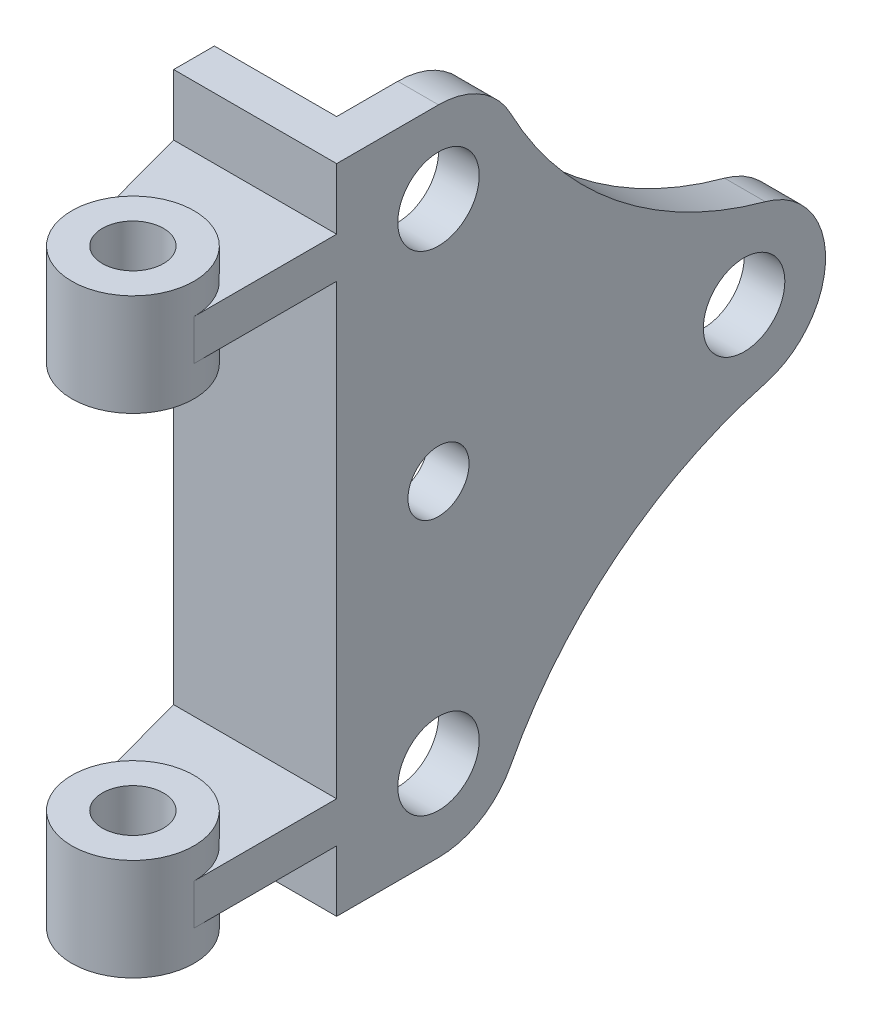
from build123d import *
from build123d.topology import SkipClean

# Parameters (mm, degrees)
BASE_EXTRUDE_DEPTH  = 6.35
SKETCH4_R           = 6.35
SKETCH4_R_2         = 4.7625
CUT_EXTRUDE1_DEPTH  = 128.158650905
SKETCH3_W           = 25.4
SKETCH3_H           = 101.6
BOSS_EXTRUDE1_DEPTH = 6.35
BOSS_EXTRUDE2_DEPTH = 3.175
SKETCH6_R           = 9.525
BOSS_EXTRUDE3_DEPTH = 7.9375
SKETCH7_R           = 4.7625
CUT_EXTRUDE2_DEPTH  = 125.686983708


with BuildPart() as part:
    # Sketch2 → Base-Extrude (new body)
    with BuildSketch(Plane(origin=(0, 0, 0), x_dir=(0, 0, -1), z_dir=(1, 0, 0))):
        with BuildLine():
            Line((0, 0), (0, 101.6))
            Line((0, 101.6), (15.875, 101.6))
            ThreePointArc((15.875, 101.6), (22.439736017, 99.771717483), (27.114363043, 94.813266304))
            ThreePointArc((27.114363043, 94.813266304), (43.64304274, 74.794428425), (66.801863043, 63.063266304))
            ThreePointArc((66.801863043, 63.063266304), (76.2, 50.8), (66.801863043, 38.536733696))
            ThreePointArc((66.801863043, 38.536733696), (43.64304274, 26.805571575), (27.114363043, 6.786733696))
            ThreePointArc((27.114363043, 6.786733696), (22.439736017, 1.828282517), (15.875, 0))
            Line((15.875, 0), (0, 0))
        make_face()
    extrude(amount=BASE_EXTRUDE_DEPTH)

    # Sketch4 → Cut-Extrude1 (cut, through all)
    with BuildSketch(Plane(origin=(6.35, 0, 0), x_dir=(0, 0, -1), z_dir=(1, 0, 0))):
        with Locations((63.5, 50.8)):
            Circle(SKETCH4_R)
        with Locations((15.875, 88.9)):
            Circle(SKETCH4_R)
        with Locations((15.875, 12.7)):
            Circle(SKETCH4_R)
        with Locations((15.875, 50.8)):
            Circle(SKETCH4_R_2)
    extrude(amount=-CUT_EXTRUDE1_DEPTH, mode=Mode.SUBTRACT)

    # Sketch3 → Boss-Extrude1 (add)
    with BuildSketch(Plane.XY):
        with Locations((-6.35, 50.8)):
            Rectangle(SKETCH3_W, SKETCH3_H)
    extrude(amount=-BOSS_EXTRUDE1_DEPTH)

    # Sketch5 → Boss-Extrude2 (add, symmetric)
    with BuildSketch(Plane(origin=(0, 88.9, 0), x_dir=(-1, 0, 0), z_dir=(0, 1, 0))):
        with BuildLine():
            Line((19.05, 0), (-6.35, 0))
            Line((-6.35, 0), (-6.35, 22.225))
            ThreePointArc((-6.35, 22.225), (1.921253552, 31.667126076), (12.369946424, 24.710676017))
            Line((12.369946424, 24.710676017), (19.05, 0))
        make_face()
    boss_extrude2 = extrude(amount=BOSS_EXTRUDE2_DEPTH, both=True)

    # Sketch6 → Boss-Extrude3 (add, symmetric)
    with SkipClean():  # the faces are left unmerged after this step: merging them gives an invalid solid
        with BuildSketch(Plane(origin=(0, 88.9, 0), x_dir=(-1, 0, 0), z_dir=(0, 1, 0))):
            with Locations(Location((3.175, 22.225, 0), (0, 0, 90))):
                Circle(SKETCH6_R)
        boss_extrude3 = extrude(amount=BOSS_EXTRUDE3_DEPTH, both=True)

    # Sketch7 → Cut-Extrude2 (cut, through all)
    with SkipClean():  # the faces are left unmerged after this step: merging them gives an invalid solid
        with BuildSketch(Plane(origin=(0, 96.8375, 0), x_dir=(-1, 0, 0), z_dir=(0, 1, 0))):
            with Locations(Location((3.175, 22.225, 0), (0, 0, 90))):
                Circle(SKETCH7_R)
        cut_extrude2 = extrude(amount=-CUT_EXTRUDE2_DEPTH, mode=Mode.SUBTRACT)

    # Mirror2: Boss-Extrude2, Boss-Extrude3, Cut-Extrude2 across plane
    with SkipClean():  # the faces are left unmerged after this step: merging them gives an invalid solid
        add(boss_extrude2.mirror(Plane.ZX.offset(50.8)))
        add(boss_extrude3.mirror(Plane.ZX.offset(50.8)))
        add(cut_extrude2.mirror(Plane.ZX.offset(50.8)), mode=Mode.SUBTRACT)


solid = part.part
